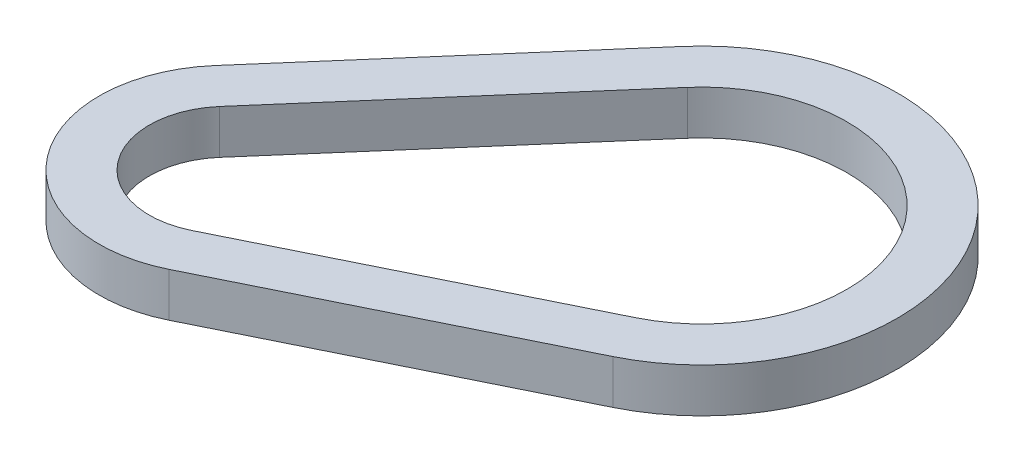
ISO-10303-21;
HEADER;
FILE_DESCRIPTION(('STEP AP214'),'2;1');
FILE_NAME('part.step','',(''),(''),'','','');
FILE_SCHEMA(('AUTOMOTIVE_DESIGN { 1 0 10303 214 1 1 1 1 }'));
ENDSEC;
DATA;
#1=APPLICATION_CONTEXT('core data for automotive mechanical design processes');
#2=APPLICATION_PROTOCOL_DEFINITION('international standard','automotive_design',2000,#1);
#3=PRODUCT_CONTEXT('',#1,'mechanical');
#4=PRODUCT('Part','Part','',(#3));
#5=PRODUCT_RELATED_PRODUCT_CATEGORY('part','',(#4));
#6=PRODUCT_DEFINITION_FORMATION('','',#4);
#7=PRODUCT_DEFINITION_CONTEXT('part definition',#1,'design');
#8=PRODUCT_DEFINITION('design','',#6,#7);
#9=PRODUCT_DEFINITION_SHAPE('','',#8);
#10=(LENGTH_UNIT() NAMED_UNIT(*) SI_UNIT(.MILLI.,.METRE.));
#11=(NAMED_UNIT(*) PLANE_ANGLE_UNIT() SI_UNIT($,.RADIAN.));
#12=(NAMED_UNIT(*) SI_UNIT($,.STERADIAN.) SOLID_ANGLE_UNIT());
#13=UNCERTAINTY_MEASURE_WITH_UNIT(LENGTH_MEASURE(1.E-05),#10,'distance_accuracy_value','');
#14=(GEOMETRIC_REPRESENTATION_CONTEXT(3) GLOBAL_UNCERTAINTY_ASSIGNED_CONTEXT((#13)) GLOBAL_UNIT_ASSIGNED_CONTEXT((#10,
#11,#12)) REPRESENTATION_CONTEXT('',''));
#15=CARTESIAN_POINT('',(0.,0.,0.));
#16=DIRECTION('',(0.,0.,1.));
#17=DIRECTION('',(1.,0.,0.));
#18=AXIS2_PLACEMENT_3D('',#15,#16,#17);
#19=CARTESIAN_POINT('',(8.2,-51.41,3.7));
#20=DIRECTION('',(0.,-1.,0.));
#21=DIRECTION('',(0.,0.,-1.));
#22=AXIS2_PLACEMENT_3D('',#19,#20,#21);
#23=CYLINDRICAL_SURFACE('',#22,2.3);
#24=CARTESIAN_POINT('',(8.2,-52.2,3.7));
#25=DIRECTION('',(0.,-1.,0.));
#26=DIRECTION('',(0.,0.,1.));
#27=AXIS2_PLACEMENT_3D('',#24,#25,#26);
#28=CIRCLE('',#27,2.3);
#29=CARTESIAN_POINT('',(9.21568157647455,-52.2,5.76358691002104));
#30=VERTEX_POINT('',#29);
#31=CARTESIAN_POINT('',(6.46294624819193,-52.2,2.19247080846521));
#32=VERTEX_POINT('',#31);
#33=EDGE_CURVE('E154',#30,#32,#28,.T.);
#34=ORIENTED_EDGE('',*,*,#33,.F.);
#35=DIRECTION('',(0.,-1.,0.));
#36=VECTOR('',#35,1.);
#37=CARTESIAN_POINT('',(9.21568157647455,-51.41,5.76358691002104));
#38=LINE('',#37,#36);
#39=CARTESIAN_POINT('',(9.21568157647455,-51.41,5.76358691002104));
#40=VERTEX_POINT('',#39);
#41=EDGE_CURVE('E13',#40,#30,#38,.T.);
#42=ORIENTED_EDGE('',*,*,#41,.F.);
#43=CARTESIAN_POINT('',(8.2,-51.41,3.7));
#44=DIRECTION('',(0.,-1.,0.));
#45=DIRECTION('',(0.,0.,1.));
#46=AXIS2_PLACEMENT_3D('',#43,#44,#45);
#47=CIRCLE('',#46,2.3);
#48=CARTESIAN_POINT('',(6.46294624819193,-51.41,2.19247080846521));
#49=VERTEX_POINT('',#48);
#50=EDGE_CURVE('E158',#40,#49,#47,.T.);
#51=ORIENTED_EDGE('',*,*,#50,.T.);
#52=DIRECTION('',(0.,-1.,0.));
#53=VECTOR('',#52,1.);
#54=CARTESIAN_POINT('',(6.46294624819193,-51.41,2.19247080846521));
#55=LINE('',#54,#53);
#56=EDGE_CURVE('E59',#49,#32,#55,.T.);
#57=ORIENTED_EDGE('',*,*,#56,.T.);
#58=EDGE_LOOP('',(#34,#42,#51,#57));
#59=FACE_BOUND('',#58,.T.);
#60=ADVANCED_FACE('F56',(#59),#23,.T.);
#61=CARTESIAN_POINT('',(9.21568157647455,-51.41,5.76358691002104));
#62=DIRECTION('',(0.441600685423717,0.,0.897211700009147));
#63=DIRECTION('',(0.897211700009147,0.,-0.441600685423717));
#64=AXIS2_PLACEMENT_3D('',#61,#62,#63);
#65=PLANE('',#64);
#66=DIRECTION('',(-0.897211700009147,0.,0.441600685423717));
#67=VECTOR('',#66,1.);
#68=CARTESIAN_POINT('',(9.21568157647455,-52.2,5.76358691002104));
#69=LINE('',#68,#67);
#70=CARTESIAN_POINT('',(14.545602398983,-52.2,3.14024095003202));
#71=VERTEX_POINT('',#70);
#72=EDGE_CURVE('E162',#71,#30,#69,.T.);
#73=ORIENTED_EDGE('',*,*,#72,.F.);
#74=DIRECTION('',(0.,-1.,0.));
#75=VECTOR('',#74,1.);
#76=CARTESIAN_POINT('',(14.545602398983,-51.41,3.14024095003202));
#77=LINE('',#76,#75);
#78=CARTESIAN_POINT('',(14.545602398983,-51.41,3.14024095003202));
#79=VERTEX_POINT('',#78);
#80=EDGE_CURVE('E64',#79,#71,#77,.T.);
#81=ORIENTED_EDGE('',*,*,#80,.F.);
#82=DIRECTION('',(-0.897211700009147,0.,0.441600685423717));
#83=VECTOR('',#82,1.);
#84=CARTESIAN_POINT('',(9.21568157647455,-51.41,5.76358691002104));
#85=LINE('',#84,#83);
#86=EDGE_CURVE('E168',#79,#40,#85,.T.);
#87=ORIENTED_EDGE('',*,*,#86,.T.);
#88=ORIENTED_EDGE('',*,*,#41,.T.);
#89=EDGE_LOOP('',(#73,#81,#87,#88));
#90=FACE_BOUND('',#89,.T.);
#91=ADVANCED_FACE('F194',(#90),#65,.T.);
#92=CARTESIAN_POINT('',(13.,-51.41,0.));
#93=DIRECTION('',(0.,-1.,0.));
#94=DIRECTION('',(0.,0.,-1.));
#95=AXIS2_PLACEMENT_3D('',#92,#93,#94);
#96=CYLINDRICAL_SURFACE('',#95,3.5);
#97=CARTESIAN_POINT('',(13.,-52.2,0.));
#98=DIRECTION('',(0.,-1.,0.));
#99=DIRECTION('',(0.,0.,-1.));
#100=AXIS2_PLACEMENT_3D('',#97,#98,#99);
#101=CIRCLE('',#100,3.5);
#102=CARTESIAN_POINT('',(10.3566573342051,-52.2,-2.2940661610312));
#103=VERTEX_POINT('',#102);
#104=EDGE_CURVE('E176',#103,#71,#101,.T.);
#105=ORIENTED_EDGE('',*,*,#104,.F.);
#106=DIRECTION('',(0.,-1.,0.));
#107=VECTOR('',#106,1.);
#108=CARTESIAN_POINT('',(10.3566573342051,-51.41,-2.2940661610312));
#109=LINE('',#108,#107);
#110=CARTESIAN_POINT('',(10.3566573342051,-51.41,-2.2940661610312));
#111=VERTEX_POINT('',#110);
#112=EDGE_CURVE('E181',#111,#103,#109,.T.);
#113=ORIENTED_EDGE('',*,*,#112,.F.);
#114=CARTESIAN_POINT('',(13.,-51.41,0.));
#115=DIRECTION('',(0.,-1.,0.));
#116=DIRECTION('',(0.,0.,-1.));
#117=AXIS2_PLACEMENT_3D('',#114,#115,#116);
#118=CIRCLE('',#117,3.5);
#119=EDGE_CURVE('E165',#111,#79,#118,.T.);
#120=ORIENTED_EDGE('',*,*,#119,.T.);
#121=ORIENTED_EDGE('',*,*,#80,.T.);
#122=EDGE_LOOP('',(#105,#113,#120,#121));
#123=FACE_BOUND('',#122,.T.);
#124=ADVANCED_FACE('F198',(#123),#96,.T.);
#125=CARTESIAN_POINT('',(6.46294624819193,-51.41,2.19247080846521));
#126=DIRECTION('',(-0.75524076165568,0.,-0.655447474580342));
#127=DIRECTION('',(-0.655447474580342,0.,0.75524076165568));
#128=AXIS2_PLACEMENT_3D('',#125,#126,#127);
#129=PLANE('',#128);
#130=DIRECTION('',(0.655447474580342,0.,-0.75524076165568));
#131=VECTOR('',#130,1.);
#132=CARTESIAN_POINT('',(6.46294624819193,-52.2,2.19247080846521));
#133=LINE('',#132,#131);
#134=EDGE_CURVE('E173',#32,#103,#133,.T.);
#135=ORIENTED_EDGE('',*,*,#134,.F.);
#136=ORIENTED_EDGE('',*,*,#56,.F.);
#137=DIRECTION('',(0.655447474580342,0.,-0.75524076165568));
#138=VECTOR('',#137,1.);
#139=CARTESIAN_POINT('',(6.46294624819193,-51.41,2.19247080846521));
#140=LINE('',#139,#138);
#141=EDGE_CURVE('E161',#49,#111,#140,.T.);
#142=ORIENTED_EDGE('',*,*,#141,.T.);
#143=ORIENTED_EDGE('',*,*,#112,.T.);
#144=EDGE_LOOP('',(#135,#136,#142,#143));
#145=FACE_BOUND('',#144,.T.);
#146=ADVANCED_FACE('F189',(#145),#129,.T.);
#147=CARTESIAN_POINT('',(8.2,-51.41,3.7));
#148=DIRECTION('',(0.,1.,0.));
#149=DIRECTION('',(0.,0.,1.));
#150=AXIS2_PLACEMENT_3D('',#147,#148,#149);
#151=PLANE('',#150);
#152=CARTESIAN_POINT('',(8.2,-51.41,3.7));
#153=DIRECTION('',(0.,-1.,0.));
#154=DIRECTION('',(0.,0.,1.));
#155=AXIS2_PLACEMENT_3D('',#152,#153,#154);
#156=CIRCLE('',#155,1.4);
#157=CARTESIAN_POINT('',(8.8182409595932,-51.41,4.95609638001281));
#158=VERTEX_POINT('',#157);
#159=CARTESIAN_POINT('',(7.14266293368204,-51.41,2.78237353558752));
#160=VERTEX_POINT('',#159);
#161=EDGE_CURVE('E123',#158,#160,#156,.T.);
#162=ORIENTED_EDGE('',*,*,#161,.T.);
#163=DIRECTION('',(0.655447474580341,0.,-0.755240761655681));
#164=VECTOR('',#163,1.);
#165=CARTESIAN_POINT('',(7.14266293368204,-51.41,2.78237353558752));
#166=LINE('',#165,#164);
#167=CARTESIAN_POINT('',(11.0363740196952,-51.41,-1.70416343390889));
#168=VERTEX_POINT('',#167);
#169=EDGE_CURVE('E132',#160,#168,#166,.T.);
#170=ORIENTED_EDGE('',*,*,#169,.T.);
#171=CARTESIAN_POINT('',(13.,-51.41,0.));
#172=DIRECTION('',(0.,-1.,0.));
#173=DIRECTION('',(0.,0.,-1.));
#174=AXIS2_PLACEMENT_3D('',#171,#172,#173);
#175=CIRCLE('',#174,2.6);
#176=CARTESIAN_POINT('',(14.1481617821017,-51.41,2.33275042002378));
#177=VERTEX_POINT('',#176);
#178=EDGE_CURVE('E72',#168,#177,#175,.T.);
#179=ORIENTED_EDGE('',*,*,#178,.T.);
#180=DIRECTION('',(-0.897211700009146,0.,0.441600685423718));
#181=VECTOR('',#180,1.);
#182=CARTESIAN_POINT('',(8.8182409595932,-51.41,4.95609638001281));
#183=LINE('',#182,#181);
#184=EDGE_CURVE('E129',#177,#158,#183,.T.);
#185=ORIENTED_EDGE('',*,*,#184,.T.);
#186=EDGE_LOOP('',(#162,#170,#179,#185));
#187=FACE_BOUND('',#186,.T.);
#188=ORIENTED_EDGE('',*,*,#50,.F.);
#189=ORIENTED_EDGE('',*,*,#86,.F.);
#190=ORIENTED_EDGE('',*,*,#119,.F.);
#191=ORIENTED_EDGE('',*,*,#141,.F.);
#192=EDGE_LOOP('',(#188,#189,#190,#191));
#193=FACE_BOUND('',#192,.T.);
#194=ADVANCED_FACE('F136',(#187,#193),#151,.T.);
#195=CARTESIAN_POINT('',(8.2,-52.2,3.7));
#196=DIRECTION('',(0.,1.,0.));
#197=DIRECTION('',(0.,0.,1.));
#198=AXIS2_PLACEMENT_3D('',#195,#196,#197);
#199=PLANE('',#198);
#200=DIRECTION('',(0.655447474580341,0.,-0.755240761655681));
#201=VECTOR('',#200,1.);
#202=CARTESIAN_POINT('',(7.14266293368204,-52.2,2.78237353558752));
#203=LINE('',#202,#201);
#204=CARTESIAN_POINT('',(7.14266293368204,-52.2,2.78237353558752));
#205=VERTEX_POINT('',#204);
#206=CARTESIAN_POINT('',(11.0363740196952,-52.2,-1.70416343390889));
#207=VERTEX_POINT('',#206);
#208=EDGE_CURVE('E148',#205,#207,#203,.T.);
#209=ORIENTED_EDGE('',*,*,#208,.F.);
#210=CARTESIAN_POINT('',(8.2,-52.2,3.7));
#211=DIRECTION('',(0.,-1.,0.));
#212=DIRECTION('',(0.,0.,1.));
#213=AXIS2_PLACEMENT_3D('',#210,#211,#212);
#214=CIRCLE('',#213,1.4);
#215=CARTESIAN_POINT('',(8.8182409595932,-52.2,4.95609638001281));
#216=VERTEX_POINT('',#215);
#217=EDGE_CURVE('E80',#216,#205,#214,.T.);
#218=ORIENTED_EDGE('',*,*,#217,.F.);
#219=DIRECTION('',(-0.897211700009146,0.,0.441600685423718));
#220=VECTOR('',#219,1.);
#221=CARTESIAN_POINT('',(8.8182409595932,-52.2,4.95609638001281));
#222=LINE('',#221,#220);
#223=CARTESIAN_POINT('',(14.1481617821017,-52.2,2.33275042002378));
#224=VERTEX_POINT('',#223);
#225=EDGE_CURVE('E139',#224,#216,#222,.T.);
#226=ORIENTED_EDGE('',*,*,#225,.F.);
#227=CARTESIAN_POINT('',(13.,-52.2,0.));
#228=DIRECTION('',(0.,-1.,0.));
#229=DIRECTION('',(0.,0.,-1.));
#230=AXIS2_PLACEMENT_3D('',#227,#228,#229);
#231=CIRCLE('',#230,2.6);
#232=EDGE_CURVE('E142',#207,#224,#231,.T.);
#233=ORIENTED_EDGE('',*,*,#232,.F.);
#234=EDGE_LOOP('',(#209,#218,#226,#233));
#235=FACE_BOUND('',#234,.T.);
#236=ORIENTED_EDGE('',*,*,#33,.T.);
#237=ORIENTED_EDGE('',*,*,#134,.T.);
#238=ORIENTED_EDGE('',*,*,#104,.T.);
#239=ORIENTED_EDGE('',*,*,#72,.T.);
#240=EDGE_LOOP('',(#236,#237,#238,#239));
#241=FACE_BOUND('',#240,.T.);
#242=ADVANCED_FACE('F191',(#235,#241),#199,.F.);
#243=CARTESIAN_POINT('',(8.2,-51.41,3.7));
#244=DIRECTION('',(0.,-1.,0.));
#245=DIRECTION('',(0.,0.,-1.));
#246=AXIS2_PLACEMENT_3D('',#243,#244,#245);
#247=CYLINDRICAL_SURFACE('',#246,1.4);
#248=ORIENTED_EDGE('',*,*,#217,.T.);
#249=DIRECTION('',(0.,-1.,0.));
#250=VECTOR('',#249,1.);
#251=CARTESIAN_POINT('',(7.14266293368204,-51.41,2.78237353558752));
#252=LINE('',#251,#250);
#253=EDGE_CURVE('E119',#160,#205,#252,.T.);
#254=ORIENTED_EDGE('',*,*,#253,.F.);
#255=ORIENTED_EDGE('',*,*,#161,.F.);
#256=DIRECTION('',(0.,-1.,0.));
#257=VECTOR('',#256,1.);
#258=CARTESIAN_POINT('',(8.8182409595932,-51.41,4.95609638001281));
#259=LINE('',#258,#257);
#260=EDGE_CURVE('E152',#158,#216,#259,.T.);
#261=ORIENTED_EDGE('',*,*,#260,.T.);
#262=EDGE_LOOP('',(#248,#254,#255,#261));
#263=FACE_BOUND('',#262,.T.);
#264=ADVANCED_FACE('F121',(#263),#247,.F.);
#265=CARTESIAN_POINT('',(8.8182409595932,-51.41,4.95609638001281));
#266=DIRECTION('',(0.441600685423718,0.,0.897211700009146));
#267=DIRECTION('',(0.897211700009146,0.,-0.441600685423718));
#268=AXIS2_PLACEMENT_3D('',#265,#266,#267);
#269=PLANE('',#268);
#270=ORIENTED_EDGE('',*,*,#225,.T.);
#271=ORIENTED_EDGE('',*,*,#260,.F.);
#272=ORIENTED_EDGE('',*,*,#184,.F.);
#273=DIRECTION('',(0.,-1.,0.));
#274=VECTOR('',#273,1.);
#275=CARTESIAN_POINT('',(14.1481617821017,-51.41,2.33275042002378));
#276=LINE('',#275,#274);
#277=EDGE_CURVE('E155',#177,#224,#276,.T.);
#278=ORIENTED_EDGE('',*,*,#277,.T.);
#279=EDGE_LOOP('',(#270,#271,#272,#278));
#280=FACE_BOUND('',#279,.T.);
#281=ADVANCED_FACE('F249',(#280),#269,.F.);
#282=CARTESIAN_POINT('',(13.,-51.41,0.));
#283=DIRECTION('',(0.,-1.,0.));
#284=DIRECTION('',(0.,0.,-1.));
#285=AXIS2_PLACEMENT_3D('',#282,#283,#284);
#286=CYLINDRICAL_SURFACE('',#285,2.6);
#287=ORIENTED_EDGE('',*,*,#232,.T.);
#288=ORIENTED_EDGE('',*,*,#277,.F.);
#289=ORIENTED_EDGE('',*,*,#178,.F.);
#290=DIRECTION('',(0.,-1.,0.));
#291=VECTOR('',#290,1.);
#292=CARTESIAN_POINT('',(11.0363740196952,-51.41,-1.70416343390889));
#293=LINE('',#292,#291);
#294=EDGE_CURVE('E128',#168,#207,#293,.T.);
#295=ORIENTED_EDGE('',*,*,#294,.T.);
#296=EDGE_LOOP('',(#287,#288,#289,#295));
#297=FACE_BOUND('',#296,.T.);
#298=ADVANCED_FACE('F258',(#297),#286,.F.);
#299=CARTESIAN_POINT('',(7.14266293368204,-51.41,2.78237353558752));
#300=DIRECTION('',(-0.755240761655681,0.,-0.655447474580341));
#301=DIRECTION('',(-0.655447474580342,0.,0.755240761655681));
#302=AXIS2_PLACEMENT_3D('',#299,#300,#301);
#303=PLANE('',#302);
#304=ORIENTED_EDGE('',*,*,#208,.T.);
#305=ORIENTED_EDGE('',*,*,#294,.F.);
#306=ORIENTED_EDGE('',*,*,#169,.F.);
#307=ORIENTED_EDGE('',*,*,#253,.T.);
#308=EDGE_LOOP('',(#304,#305,#306,#307));
#309=FACE_BOUND('',#308,.T.);
#310=ADVANCED_FACE('F133',(#309),#303,.F.);
#311=CLOSED_SHELL('',(#60,#91,#124,#146,#194,#242,#264,#281,#298,#310));
#312=MANIFOLD_SOLID_BREP('B2',#311);
#313=ADVANCED_BREP_SHAPE_REPRESENTATION('',(#18,#312),#14);
#314=SHAPE_DEFINITION_REPRESENTATION(#9,#313);
ENDSEC;
END-ISO-10303-21;
